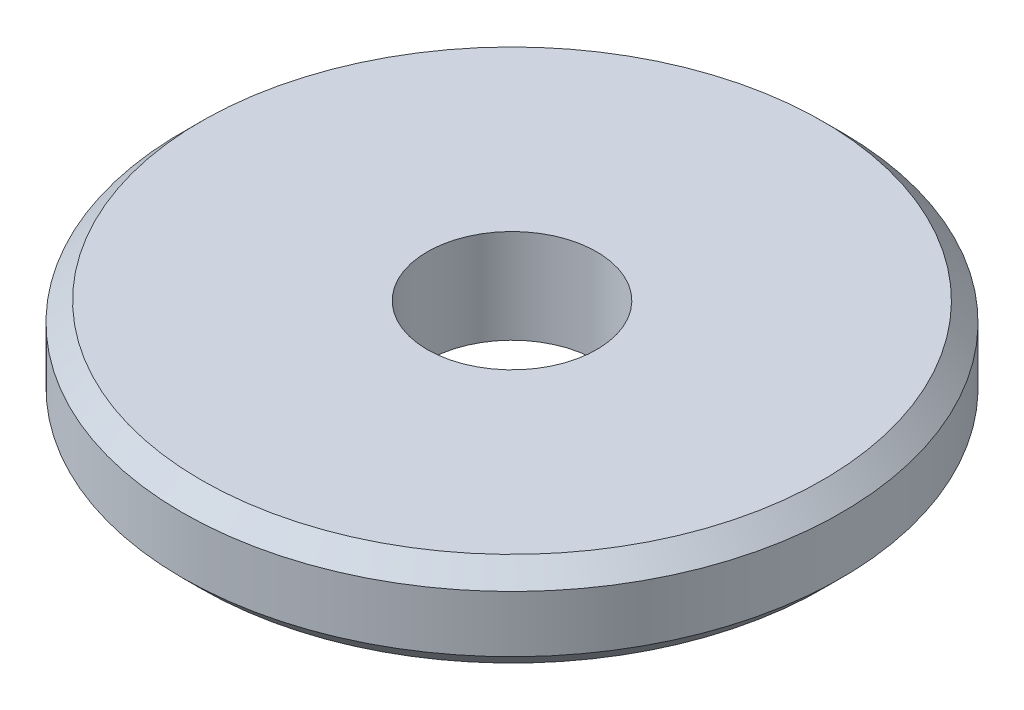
from build123d import *

# Parameters (mm, degrees)
SKETCH1_R      = 17.5
SKETCH1_R_2    = 4.5
EXTRUDE1_DEPTH = 5
CHAMFER1_SIZE  = 1


with BuildPart() as part:
    # Sketch1 → Extrude1 (new body)
    with BuildSketch(Plane(origin=(0, 0, 0), x_dir=(1, 0, 0), z_dir=(0, 1, 0))):
        with Locations(Location((0, 0, 0), (0, 0, 270))):
            Circle(SKETCH1_R)
        with Locations(Location((0, 0, 0), (0, 0, 270))):
            Circle(SKETCH1_R_2, mode=Mode.SUBTRACT)
    extrude(amount=EXTRUDE1_DEPTH)

    # Chamfer1
    chamfer1_edges = [part.edges().sort_by_distance(p)[0] for p in [
        (0, 0, -17.5),
        (0, 5, -17.5),
    ]]
    chamfer(chamfer1_edges, length=CHAMFER1_SIZE)


solid = part.part
